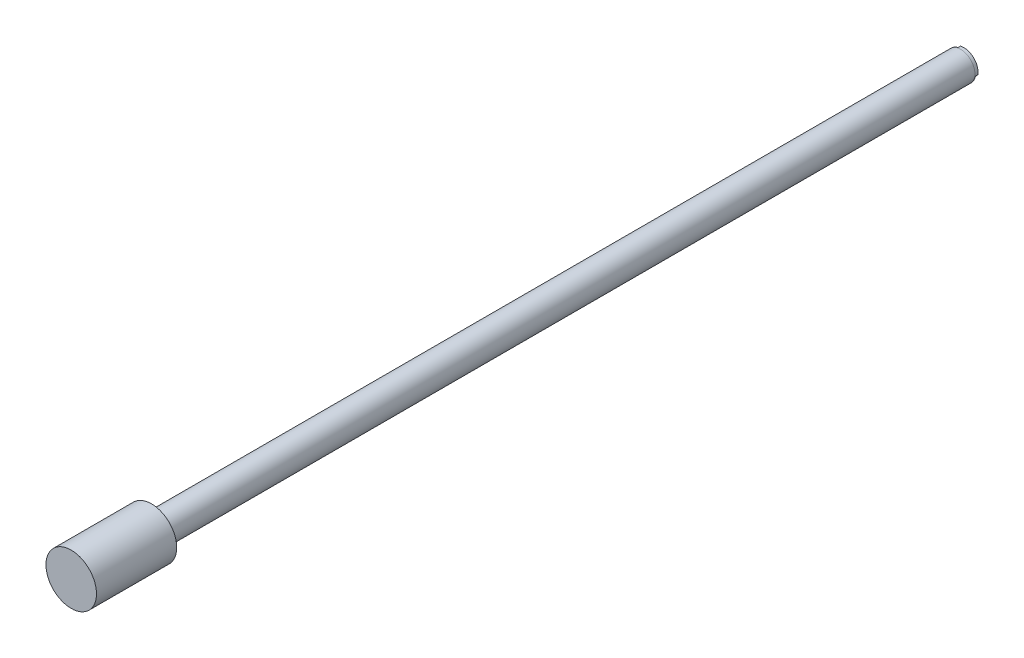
ISO-10303-21;
HEADER;
FILE_DESCRIPTION(('STEP AP214'),'2;1');
FILE_NAME('part.step','',(''),(''),'','','');
FILE_SCHEMA(('AUTOMOTIVE_DESIGN { 1 0 10303 214 1 1 1 1 }'));
ENDSEC;
DATA;
#1=APPLICATION_CONTEXT('core data for automotive mechanical design processes');
#2=APPLICATION_PROTOCOL_DEFINITION('international standard','automotive_design',2000,#1);
#3=PRODUCT_CONTEXT('',#1,'mechanical');
#4=PRODUCT('Part','Part','',(#3));
#5=PRODUCT_RELATED_PRODUCT_CATEGORY('part','',(#4));
#6=PRODUCT_DEFINITION_FORMATION('','',#4);
#7=PRODUCT_DEFINITION_CONTEXT('part definition',#1,'design');
#8=PRODUCT_DEFINITION('design','',#6,#7);
#9=PRODUCT_DEFINITION_SHAPE('','',#8);
#10=(LENGTH_UNIT() NAMED_UNIT(*) SI_UNIT(.MILLI.,.METRE.));
#11=(NAMED_UNIT(*) PLANE_ANGLE_UNIT() SI_UNIT($,.RADIAN.));
#12=(NAMED_UNIT(*) SI_UNIT($,.STERADIAN.) SOLID_ANGLE_UNIT());
#13=UNCERTAINTY_MEASURE_WITH_UNIT(LENGTH_MEASURE(1.E-05),#10,'distance_accuracy_value','');
#14=(GEOMETRIC_REPRESENTATION_CONTEXT(3) GLOBAL_UNCERTAINTY_ASSIGNED_CONTEXT((#13)) GLOBAL_UNIT_ASSIGNED_CONTEXT((#10,
#11,#12)) REPRESENTATION_CONTEXT('',''));
#15=CARTESIAN_POINT('',(0.,0.,0.));
#16=DIRECTION('',(0.,0.,1.));
#17=DIRECTION('',(1.,0.,0.));
#18=AXIS2_PLACEMENT_3D('',#15,#16,#17);
#19=CARTESIAN_POINT('',(0.,0.,-1654.683));
#20=DIRECTION('',(0.,0.,-1.));
#21=DIRECTION('',(-1.,0.,0.));
#22=AXIS2_PLACEMENT_3D('',#19,#20,#21);
#23=PLANE('',#22);
#24=CARTESIAN_POINT('',(0.,0.,-1654.683));
#25=DIRECTION('',(0.,0.,-1.));
#26=DIRECTION('',(0.,1.,0.));
#27=AXIS2_PLACEMENT_3D('',#24,#25,#26);
#28=CIRCLE('',#27,8.73125);
#29=CARTESIAN_POINT('',(0.,8.73125000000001,-1654.683));
#30=VERTEX_POINT('',#29);
#31=EDGE_CURVE('E10',#30,#30,#28,.F.);
#32=ORIENTED_EDGE('',*,*,#31,.F.);
#33=EDGE_LOOP('',(#32));
#34=FACE_BOUND('',#33,.T.);
#35=ADVANCED_FACE('F16',(#34),#23,.T.);
#36=CARTESIAN_POINT('',(0.,0.,-1688.0205));
#37=DIRECTION('',(0.,0.,-1.));
#38=DIRECTION('',(-0.681998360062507,-0.731353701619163,0.));
#39=AXIS2_PLACEMENT_3D('',#36,#37,#38);
#40=PLANE('',#39);
#41=CARTESIAN_POINT('',(0.,0.,-1688.0205));
#42=DIRECTION('',(0.,0.,-1.));
#43=DIRECTION('',(-0.681998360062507,-0.731353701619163,0.));
#44=AXIS2_PLACEMENT_3D('',#41,#42,#43);
#45=CIRCLE('',#44,28.4607);
#46=CARTESIAN_POINT('',(28.046143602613,-4.83996627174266,-1688.0205));
#47=VERTEX_POINT('',#46);
#48=CARTESIAN_POINT('',(6.78457643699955,-27.6402056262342,-1688.0205));
#49=VERTEX_POINT('',#48);
#50=EDGE_CURVE('E62',#47,#49,#45,.T.);
#51=ORIENTED_EDGE('',*,*,#50,.T.);
#52=DIRECTION('',(0.681998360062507,0.731353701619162,0.));
#53=VECTOR('',#52,1.);
#54=CARTESIAN_POINT('',(28.046143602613,-4.83996627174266,-1688.0205));
#55=LINE('',#54,#53);
#56=EDGE_CURVE('E64',#49,#47,#55,.T.);
#57=ORIENTED_EDGE('',*,*,#56,.T.);
#58=EDGE_LOOP('',(#51,#57));
#59=FACE_BOUND('',#58,.T.);
#60=ADVANCED_FACE('F63',(#59),#40,.T.);
#61=CARTESIAN_POINT('',(0.,0.,-1688.0205));
#62=DIRECTION('',(0.,0.,-1.));
#63=DIRECTION('',(-0.681998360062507,-0.731353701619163,0.));
#64=AXIS2_PLACEMENT_3D('',#61,#62,#63);
#65=PLANE('',#64);
#66=CARTESIAN_POINT('',(0.,0.,-1688.0205));
#67=DIRECTION('',(0.,0.,-1.));
#68=DIRECTION('',(-0.681998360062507,-0.731353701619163,0.));
#69=AXIS2_PLACEMENT_3D('',#66,#67,#68);
#70=CIRCLE('',#69,28.4607);
#71=CARTESIAN_POINT('',(-28.0461436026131,4.83996627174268,-1688.0205));
#72=VERTEX_POINT('',#71);
#73=CARTESIAN_POINT('',(-6.78457643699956,27.6402056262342,-1688.0205));
#74=VERTEX_POINT('',#73);
#75=EDGE_CURVE('E82',#72,#74,#70,.T.);
#76=ORIENTED_EDGE('',*,*,#75,.T.);
#77=DIRECTION('',(-0.681998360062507,-0.731353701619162,0.));
#78=VECTOR('',#77,1.);
#79=CARTESIAN_POINT('',(-6.78457643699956,27.6402056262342,-1688.0205));
#80=LINE('',#79,#78);
#81=EDGE_CURVE('E84',#74,#72,#80,.T.);
#82=ORIENTED_EDGE('',*,*,#81,.T.);
#83=EDGE_LOOP('',(#76,#82));
#84=FACE_BOUND('',#83,.T.);
#85=ADVANCED_FACE('F137',(#84),#65,.T.);
#86=CARTESIAN_POINT('',(-6.78457643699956,27.6402056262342,-1688.0205));
#87=DIRECTION('',(0.731353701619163,-0.681998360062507,0.));
#88=DIRECTION('',(0.,0.,-1.));
#89=AXIS2_PLACEMENT_3D('',#86,#87,#88);
#90=PLANE('',#89);
#91=DIRECTION('',(-0.681998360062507,-0.731353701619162,0.));
#92=VECTOR('',#91,1.);
#93=CARTESIAN_POINT('',(-6.78457643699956,27.6402056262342,-1692.783));
#94=LINE('',#93,#92);
#95=CARTESIAN_POINT('',(-6.78457643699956,27.6402056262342,-1692.783));
#96=VERTEX_POINT('',#95);
#97=CARTESIAN_POINT('',(-28.0461436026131,4.83996627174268,-1692.783));
#98=VERTEX_POINT('',#97);
#99=EDGE_CURVE('E78',#96,#98,#94,.T.);
#100=ORIENTED_EDGE('',*,*,#99,.T.);
#101=DIRECTION('',(0.,0.,-1.));
#102=VECTOR('',#101,1.);
#103=CARTESIAN_POINT('',(-28.0461436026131,4.83996627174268,-1688.0205));
#104=LINE('',#103,#102);
#105=EDGE_CURVE('E88',#72,#98,#104,.T.);
#106=ORIENTED_EDGE('',*,*,#105,.F.);
#107=ORIENTED_EDGE('',*,*,#81,.F.);
#108=DIRECTION('',(0.,0.,-1.));
#109=VECTOR('',#108,1.);
#110=CARTESIAN_POINT('',(-6.78457643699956,27.6402056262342,-1688.0205));
#111=LINE('',#110,#109);
#112=EDGE_CURVE('E41',#74,#96,#111,.T.);
#113=ORIENTED_EDGE('',*,*,#112,.T.);
#114=EDGE_LOOP('',(#100,#106,#107,#113));
#115=FACE_BOUND('',#114,.T.);
#116=ADVANCED_FACE('F197',(#115),#90,.F.);
#117=CARTESIAN_POINT('',(0.,0.,-1692.783));
#118=DIRECTION('',(0.,0.,-1.));
#119=DIRECTION('',(-0.681998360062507,-0.731353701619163,0.));
#120=AXIS2_PLACEMENT_3D('',#117,#118,#119);
#121=PLANE('',#120);
#122=DIRECTION('',(0.681998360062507,0.731353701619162,0.));
#123=VECTOR('',#122,1.);
#124=CARTESIAN_POINT('',(28.046143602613,-4.83996627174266,-1692.783));
#125=LINE('',#124,#123);
#126=CARTESIAN_POINT('',(6.78457643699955,-27.6402056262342,-1692.783));
#127=VERTEX_POINT('',#126);
#128=CARTESIAN_POINT('',(28.046143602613,-4.83996627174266,-1692.783));
#129=VERTEX_POINT('',#128);
#130=EDGE_CURVE('E67',#127,#129,#125,.T.);
#131=ORIENTED_EDGE('',*,*,#130,.F.);
#132=CARTESIAN_POINT('',(0.,0.,-1692.783));
#133=DIRECTION('',(0.,0.,-1.));
#134=DIRECTION('',(-0.681998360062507,-0.731353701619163,0.));
#135=AXIS2_PLACEMENT_3D('',#132,#133,#134);
#136=CIRCLE('',#135,28.4607);
#137=EDGE_CURVE('E76',#127,#98,#136,.T.);
#138=ORIENTED_EDGE('',*,*,#137,.T.);
#139=ORIENTED_EDGE('',*,*,#99,.F.);
#140=EDGE_CURVE('E94',#96,#129,#136,.T.);
#141=ORIENTED_EDGE('',*,*,#140,.T.);
#142=EDGE_LOOP('',(#131,#138,#139,#141));
#143=FACE_BOUND('',#142,.T.);
#144=CARTESIAN_POINT('',(0.,0.,-1692.783));
#145=DIRECTION('',(0.,0.,-1.));
#146=DIRECTION('',(-0.681998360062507,-0.731353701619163,0.));
#147=AXIS2_PLACEMENT_3D('',#144,#145,#146);
#148=CIRCLE('',#147,8.73125);
#149=CARTESIAN_POINT('',(-5.95469818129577,-6.38563200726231,-1692.783));
#150=VERTEX_POINT('',#149);
#151=EDGE_CURVE('E90',#150,#150,#148,.T.);
#152=ORIENTED_EDGE('',*,*,#151,.F.);
#153=EDGE_LOOP('',(#152));
#154=FACE_BOUND('',#153,.T.);
#155=ADVANCED_FACE('F205',(#143,#154),#121,.T.);
#156=CARTESIAN_POINT('',(0.,0.,-1692.783));
#157=DIRECTION('',(0.,0.,-1.));
#158=DIRECTION('',(-0.681998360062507,-0.731353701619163,0.));
#159=AXIS2_PLACEMENT_3D('',#156,#157,#158);
#160=CYLINDRICAL_SURFACE('',#159,8.73125);
#161=ORIENTED_EDGE('',*,*,#151,.T.);
#162=EDGE_LOOP('',(#161));
#163=FACE_BOUND('',#162,.T.);
#164=ORIENTED_EDGE('',*,*,#31,.T.);
#165=EDGE_LOOP('',(#164));
#166=FACE_BOUND('',#165,.T.);
#167=ADVANCED_FACE('F213',(#163,#166),#160,.F.);
#168=CARTESIAN_POINT('',(28.046143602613,-4.83996627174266,-1688.0205));
#169=DIRECTION('',(-0.731353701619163,0.681998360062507,0.));
#170=DIRECTION('',(0.,0.,1.));
#171=AXIS2_PLACEMENT_3D('',#168,#169,#170);
#172=PLANE('',#171);
#173=ORIENTED_EDGE('',*,*,#130,.T.);
#174=DIRECTION('',(0.,0.,-1.));
#175=VECTOR('',#174,1.);
#176=CARTESIAN_POINT('',(28.046143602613,-4.83996627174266,-1688.0205));
#177=LINE('',#176,#175);
#178=EDGE_CURVE('E70',#47,#129,#177,.T.);
#179=ORIENTED_EDGE('',*,*,#178,.F.);
#180=ORIENTED_EDGE('',*,*,#56,.F.);
#181=DIRECTION('',(0.,0.,-1.));
#182=VECTOR('',#181,1.);
#183=CARTESIAN_POINT('',(6.78457643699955,-27.6402056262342,-1688.0205));
#184=LINE('',#183,#182);
#185=EDGE_CURVE('E33',#49,#127,#184,.T.);
#186=ORIENTED_EDGE('',*,*,#185,.T.);
#187=EDGE_LOOP('',(#173,#179,#180,#186));
#188=FACE_BOUND('',#187,.T.);
#189=ADVANCED_FACE('F69',(#188),#172,.F.);
#190=CARTESIAN_POINT('',(0.,0.,-1697.0430518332));
#191=DIRECTION('',(0.,0.,-1.));
#192=DIRECTION('',(-0.681998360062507,-0.731353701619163,0.));
#193=AXIS2_PLACEMENT_3D('',#190,#191,#192);
#194=CYLINDRICAL_SURFACE('',#193,28.4607);
#195=ORIENTED_EDGE('',*,*,#178,.T.);
#196=ORIENTED_EDGE('',*,*,#140,.F.);
#197=ORIENTED_EDGE('',*,*,#112,.F.);
#198=ORIENTED_EDGE('',*,*,#75,.F.);
#199=ORIENTED_EDGE('',*,*,#105,.T.);
#200=ORIENTED_EDGE('',*,*,#137,.F.);
#201=ORIENTED_EDGE('',*,*,#185,.F.);
#202=ORIENTED_EDGE('',*,*,#50,.F.);
#203=EDGE_LOOP('',(#195,#196,#197,#198,#199,#200,#201,#202));
#204=FACE_BOUND('',#203,.T.);
#205=CARTESIAN_POINT('',(0.,0.,-1686.433));
#206=DIRECTION('',(0.,0.,-1.));
#207=DIRECTION('',(-0.681998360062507,-0.731353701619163,0.));
#208=AXIS2_PLACEMENT_3D('',#205,#206,#207);
#209=CIRCLE('',#208,28.4607);
#210=CARTESIAN_POINT('',(-19.410150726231,-20.8148382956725,-1686.433));
#211=VERTEX_POINT('',#210);
#212=EDGE_CURVE('E25',#211,#211,#209,.T.);
#213=ORIENTED_EDGE('',*,*,#212,.T.);
#214=EDGE_LOOP('',(#213));
#215=FACE_BOUND('',#214,.T.);
#216=ADVANCED_FACE('F73',(#204,#215),#194,.T.);
#217=CARTESIAN_POINT('',(0.,0.,101.6));
#218=DIRECTION('',(0.,0.,1.));
#219=DIRECTION('',(1.,0.,0.));
#220=AXIS2_PLACEMENT_3D('',#217,#218,#219);
#221=PLANE('',#220);
#222=CARTESIAN_POINT('',(0.,0.,101.6));
#223=DIRECTION('',(0.,0.,1.));
#224=DIRECTION('',(1.,0.,0.));
#225=AXIS2_PLACEMENT_3D('',#222,#223,#224);
#226=CIRCLE('',#225,50.8);
#227=CARTESIAN_POINT('',(50.8,0.,101.6));
#228=VERTEX_POINT('',#227);
#229=EDGE_CURVE('E99',#228,#228,#226,.T.);
#230=ORIENTED_EDGE('',*,*,#229,.T.);
#231=EDGE_LOOP('',(#230));
#232=FACE_BOUND('',#231,.T.);
#233=ADVANCED_FACE('F116',(#232),#221,.T.);
#234=CARTESIAN_POINT('',(0.,0.,-59.69));
#235=DIRECTION('',(0.,0.,1.));
#236=DIRECTION('',(1.,0.,0.));
#237=AXIS2_PLACEMENT_3D('',#234,#235,#236);
#238=CYLINDRICAL_SURFACE('',#237,50.8);
#239=CARTESIAN_POINT('',(0.,0.,-59.69));
#240=DIRECTION('',(0.,0.,1.));
#241=DIRECTION('',(1.,0.,0.));
#242=AXIS2_PLACEMENT_3D('',#239,#240,#241);
#243=CIRCLE('',#242,50.8);
#244=CARTESIAN_POINT('',(50.8,0.,-59.69));
#245=VERTEX_POINT('',#244);
#246=EDGE_CURVE('E102',#245,#245,#243,.T.);
#247=ORIENTED_EDGE('',*,*,#246,.T.);
#248=EDGE_LOOP('',(#247));
#249=FACE_BOUND('',#248,.T.);
#250=ORIENTED_EDGE('',*,*,#229,.F.);
#251=EDGE_LOOP('',(#250));
#252=FACE_BOUND('',#251,.T.);
#253=ADVANCED_FACE('F124',(#249,#252),#238,.T.);
#254=CARTESIAN_POINT('',(0.,0.,-59.69));
#255=DIRECTION('',(0.,0.,1.));
#256=DIRECTION('',(1.,0.,0.));
#257=AXIS2_PLACEMENT_3D('',#254,#255,#256);
#258=PLANE('',#257);
#259=ORIENTED_EDGE('',*,*,#246,.F.);
#260=EDGE_LOOP('',(#259));
#261=FACE_BOUND('',#260,.T.);
#262=CARTESIAN_POINT('',(0.,0.,-59.69));
#263=DIRECTION('',(0.,0.,1.));
#264=DIRECTION('',(1.,0.,0.));
#265=AXIS2_PLACEMENT_3D('',#262,#263,#264);
#266=CIRCLE('',#265,28.575);
#267=CARTESIAN_POINT('',(28.575,0.,-59.69));
#268=VERTEX_POINT('',#267);
#269=EDGE_CURVE('E104',#268,#268,#266,.T.);
#270=ORIENTED_EDGE('',*,*,#269,.T.);
#271=EDGE_LOOP('',(#270));
#272=FACE_BOUND('',#271,.T.);
#273=ADVANCED_FACE('F115',(#261,#272),#258,.F.);
#274=CARTESIAN_POINT('',(0.,0.,-1686.433));
#275=DIRECTION('',(0.,0.,1.));
#276=DIRECTION('',(1.,0.,0.));
#277=AXIS2_PLACEMENT_3D('',#274,#275,#276);
#278=CYLINDRICAL_SURFACE('',#277,28.575);
#279=CARTESIAN_POINT('',(0.,0.,-1686.433));
#280=DIRECTION('',(0.,0.,-1.));
#281=DIRECTION('',(-1.,0.,0.));
#282=AXIS2_PLACEMENT_3D('',#279,#280,#281);
#283=CIRCLE('',#282,28.575);
#284=CARTESIAN_POINT('',(-28.5750000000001,0.,-1686.433));
#285=VERTEX_POINT('',#284);
#286=EDGE_CURVE('E20',#285,#285,#283,.T.);
#287=ORIENTED_EDGE('',*,*,#286,.F.);
#288=EDGE_LOOP('',(#287));
#289=FACE_BOUND('',#288,.T.);
#290=ORIENTED_EDGE('',*,*,#269,.F.);
#291=EDGE_LOOP('',(#290));
#292=FACE_BOUND('',#291,.T.);
#293=ADVANCED_FACE('F18',(#289,#292),#278,.T.);
#294=CARTESIAN_POINT('',(0.,0.,-1686.433));
#295=DIRECTION('',(0.,0.,-1.));
#296=DIRECTION('',(-1.,0.,0.));
#297=AXIS2_PLACEMENT_3D('',#294,#295,#296);
#298=PLANE('',#297);
#299=ORIENTED_EDGE('',*,*,#212,.F.);
#300=EDGE_LOOP('',(#299));
#301=FACE_BOUND('',#300,.T.);
#302=ORIENTED_EDGE('',*,*,#286,.T.);
#303=EDGE_LOOP('',(#302));
#304=FACE_BOUND('',#303,.T.);
#305=ADVANCED_FACE('F111',(#301,#304),#298,.T.);
#306=CLOSED_SHELL('',(#35,#60,#85,#116,#155,#167,#189,#216,#233,#253,#273,#293,#305));
#307=MANIFOLD_SOLID_BREP('B1',#306);
#308=ADVANCED_BREP_SHAPE_REPRESENTATION('',(#18,#307),#14);
#309=SHAPE_DEFINITION_REPRESENTATION(#9,#308);
ENDSEC;
END-ISO-10303-21;
